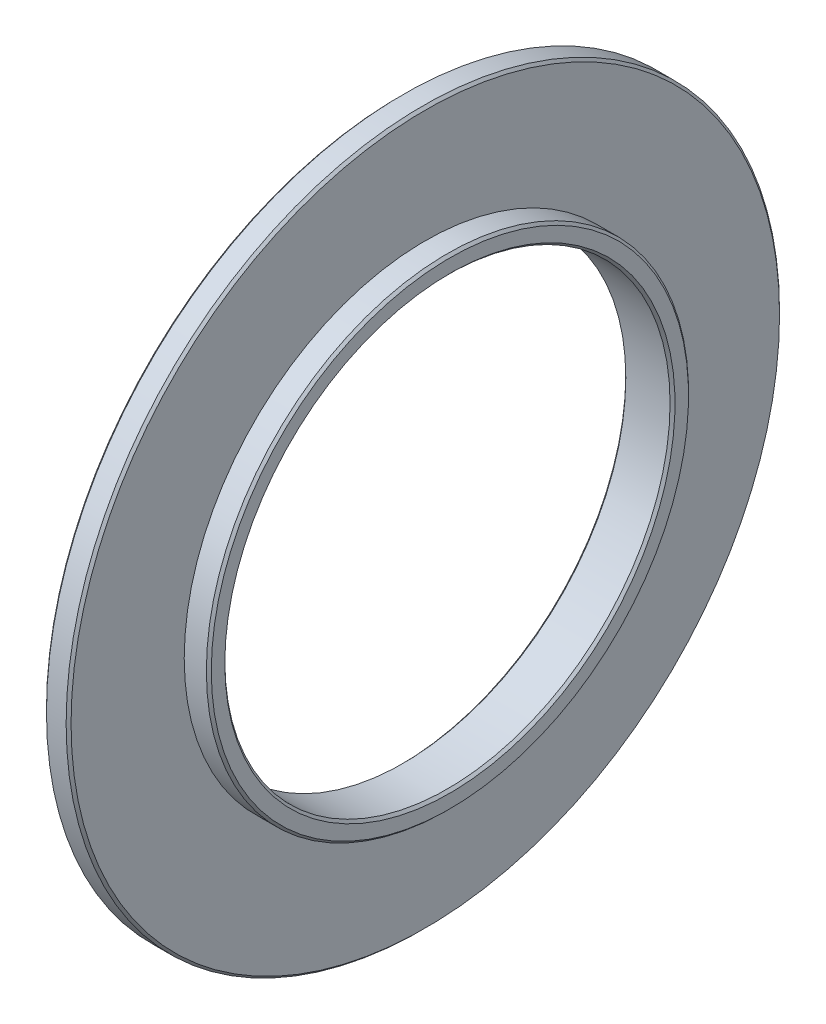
ISO-10303-21;
HEADER;
FILE_DESCRIPTION(('STEP AP214'),'2;1');
FILE_NAME('part.step','',(''),(''),'','','');
FILE_SCHEMA(('AUTOMOTIVE_DESIGN { 1 0 10303 214 1 1 1 1 }'));
ENDSEC;
DATA;
#1=APPLICATION_CONTEXT('core data for automotive mechanical design processes');
#2=APPLICATION_PROTOCOL_DEFINITION('international standard','automotive_design',2000,#1);
#3=PRODUCT_CONTEXT('',#1,'mechanical');
#4=PRODUCT('Part','Part','',(#3));
#5=PRODUCT_RELATED_PRODUCT_CATEGORY('part','',(#4));
#6=PRODUCT_DEFINITION_FORMATION('','',#4);
#7=PRODUCT_DEFINITION_CONTEXT('part definition',#1,'design');
#8=PRODUCT_DEFINITION('design','',#6,#7);
#9=PRODUCT_DEFINITION_SHAPE('','',#8);
#10=(LENGTH_UNIT() NAMED_UNIT(*) SI_UNIT(.MILLI.,.METRE.));
#11=(NAMED_UNIT(*) PLANE_ANGLE_UNIT() SI_UNIT($,.RADIAN.));
#12=(NAMED_UNIT(*) SI_UNIT($,.STERADIAN.) SOLID_ANGLE_UNIT());
#13=UNCERTAINTY_MEASURE_WITH_UNIT(LENGTH_MEASURE(1.E-05),#10,'distance_accuracy_value','');
#14=(GEOMETRIC_REPRESENTATION_CONTEXT(3) GLOBAL_UNCERTAINTY_ASSIGNED_CONTEXT((#13)) GLOBAL_UNIT_ASSIGNED_CONTEXT((#10,
#11,#12)) REPRESENTATION_CONTEXT('',''));
#15=CARTESIAN_POINT('',(0.,0.,0.));
#16=DIRECTION('',(0.,0.,1.));
#17=DIRECTION('',(1.,0.,0.));
#18=AXIS2_PLACEMENT_3D('',#15,#16,#17);
#19=CARTESIAN_POINT('',(0.,0.,0.));
#20=DIRECTION('',(-1.,0.,0.));
#21=DIRECTION('',(0.,0.,1.));
#22=AXIS2_PLACEMENT_3D('',#19,#20,#21);
#23=CYLINDRICAL_SURFACE('',#22,72.5);
#24=CARTESIAN_POINT('',(0.499999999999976,0.,0.));
#25=DIRECTION('',(1.,0.,0.));
#26=DIRECTION('',(0.,0.,-1.));
#27=AXIS2_PLACEMENT_3D('',#24,#25,#26);
#28=CIRCLE('',#27,72.5);
#29=CARTESIAN_POINT('',(0.499999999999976,0.,-72.5));
#30=VERTEX_POINT('',#29);
#31=EDGE_CURVE('E48',#30,#30,#28,.T.);
#32=ORIENTED_EDGE('',*,*,#31,.T.);
#33=EDGE_LOOP('',(#32));
#34=FACE_BOUND('',#33,.T.);
#35=CARTESIAN_POINT('',(4.50000000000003,0.,0.));
#36=DIRECTION('',(-1.,0.,0.));
#37=DIRECTION('',(0.,0.,1.));
#38=AXIS2_PLACEMENT_3D('',#35,#36,#37);
#39=CIRCLE('',#38,72.5);
#40=CARTESIAN_POINT('',(4.50000000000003,0.,72.5));
#41=VERTEX_POINT('',#40);
#42=EDGE_CURVE('E51',#41,#41,#39,.T.);
#43=ORIENTED_EDGE('',*,*,#42,.T.);
#44=EDGE_LOOP('',(#43));
#45=FACE_BOUND('',#44,.T.);
#46=ADVANCED_FACE('F29',(#34,#45),#23,.T.);
#47=CARTESIAN_POINT('',(5.,49.,0.));
#48=DIRECTION('',(-1.,0.,0.));
#49=DIRECTION('',(0.,0.,1.));
#50=AXIS2_PLACEMENT_3D('',#47,#48,#49);
#51=PLANE('',#50);
#52=CARTESIAN_POINT('',(5.,0.,0.));
#53=DIRECTION('',(-1.,0.,0.));
#54=DIRECTION('',(0.,0.,1.));
#55=AXIS2_PLACEMENT_3D('',#52,#53,#54);
#56=CIRCLE('',#55,72.);
#57=CARTESIAN_POINT('',(5.,0.,72.));
#58=VERTEX_POINT('',#57);
#59=EDGE_CURVE('E10',#58,#58,#56,.F.);
#60=ORIENTED_EDGE('',*,*,#59,.T.);
#61=EDGE_LOOP('',(#60));
#62=FACE_BOUND('',#61,.T.);
#63=CARTESIAN_POINT('',(5.,0.,0.));
#64=DIRECTION('',(-1.,0.,0.));
#65=DIRECTION('',(0.,0.,1.));
#66=AXIS2_PLACEMENT_3D('',#63,#64,#65);
#67=CIRCLE('',#66,49.);
#68=CARTESIAN_POINT('',(5.,0.,49.));
#69=VERTEX_POINT('',#68);
#70=EDGE_CURVE('E66',#69,#69,#67,.T.);
#71=ORIENTED_EDGE('',*,*,#70,.T.);
#72=EDGE_LOOP('',(#71));
#73=FACE_BOUND('',#72,.T.);
#74=ADVANCED_FACE('F70',(#62,#73),#51,.F.);
#75=CARTESIAN_POINT('',(0.,0.,0.));
#76=DIRECTION('',(-1.,0.,0.));
#77=DIRECTION('',(0.,0.,1.));
#78=AXIS2_PLACEMENT_3D('',#75,#76,#77);
#79=CYLINDRICAL_SURFACE('',#78,49.);
#80=CARTESIAN_POINT('',(9.5,0.,0.));
#81=DIRECTION('',(-1.,0.,0.));
#82=DIRECTION('',(0.,0.,1.));
#83=AXIS2_PLACEMENT_3D('',#80,#81,#82);
#84=CIRCLE('',#83,49.);
#85=CARTESIAN_POINT('',(9.5,0.,49.));
#86=VERTEX_POINT('',#85);
#87=EDGE_CURVE('E35',#86,#86,#84,.T.);
#88=ORIENTED_EDGE('',*,*,#87,.T.);
#89=EDGE_LOOP('',(#88));
#90=FACE_BOUND('',#89,.T.);
#91=ORIENTED_EDGE('',*,*,#70,.F.);
#92=EDGE_LOOP('',(#91));
#93=FACE_BOUND('',#92,.T.);
#94=ADVANCED_FACE('F72',(#90,#93),#79,.T.);
#95=CARTESIAN_POINT('',(10.,45.25,0.));
#96=DIRECTION('',(-1.,0.,0.));
#97=DIRECTION('',(0.,0.,1.));
#98=AXIS2_PLACEMENT_3D('',#95,#96,#97);
#99=PLANE('',#98);
#100=CARTESIAN_POINT('',(10.,0.,0.));
#101=DIRECTION('',(-1.,0.,0.));
#102=DIRECTION('',(0.,0.,1.));
#103=AXIS2_PLACEMENT_3D('',#100,#101,#102);
#104=CIRCLE('',#103,45.75);
#105=CARTESIAN_POINT('',(10.,0.,45.75));
#106=VERTEX_POINT('',#105);
#107=EDGE_CURVE('E39',#106,#106,#104,.T.);
#108=ORIENTED_EDGE('',*,*,#107,.T.);
#109=EDGE_LOOP('',(#108));
#110=FACE_BOUND('',#109,.T.);
#111=CARTESIAN_POINT('',(10.,0.,0.));
#112=DIRECTION('',(-1.,0.,0.));
#113=DIRECTION('',(0.,0.,1.));
#114=AXIS2_PLACEMENT_3D('',#111,#112,#113);
#115=CIRCLE('',#114,48.5);
#116=CARTESIAN_POINT('',(10.,0.,48.5));
#117=VERTEX_POINT('',#116);
#118=EDGE_CURVE('E43',#117,#117,#115,.F.);
#119=ORIENTED_EDGE('',*,*,#118,.T.);
#120=EDGE_LOOP('',(#119));
#121=FACE_BOUND('',#120,.T.);
#122=ADVANCED_FACE('F74',(#110,#121),#99,.F.);
#123=CARTESIAN_POINT('',(0.,0.,0.));
#124=DIRECTION('',(-1.,0.,0.));
#125=DIRECTION('',(0.,0.,1.));
#126=AXIS2_PLACEMENT_3D('',#123,#124,#125);
#127=CYLINDRICAL_SURFACE('',#126,45.25);
#128=CARTESIAN_POINT('',(0.500000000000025,0.,0.));
#129=DIRECTION('',(1.,0.,0.));
#130=DIRECTION('',(0.,0.,-1.));
#131=AXIS2_PLACEMENT_3D('',#128,#129,#130);
#132=CIRCLE('',#131,45.25);
#133=CARTESIAN_POINT('',(0.500000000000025,0.,-45.25));
#134=VERTEX_POINT('',#133);
#135=EDGE_CURVE('E60',#134,#134,#132,.F.);
#136=ORIENTED_EDGE('',*,*,#135,.T.);
#137=EDGE_LOOP('',(#136));
#138=FACE_BOUND('',#137,.T.);
#139=CARTESIAN_POINT('',(9.50000000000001,0.,0.));
#140=DIRECTION('',(-1.,0.,0.));
#141=DIRECTION('',(0.,0.,1.));
#142=AXIS2_PLACEMENT_3D('',#139,#140,#141);
#143=CIRCLE('',#142,45.25);
#144=CARTESIAN_POINT('',(9.50000000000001,0.,45.25));
#145=VERTEX_POINT('',#144);
#146=EDGE_CURVE('E63',#145,#145,#143,.F.);
#147=ORIENTED_EDGE('',*,*,#146,.T.);
#148=EDGE_LOOP('',(#147));
#149=FACE_BOUND('',#148,.T.);
#150=ADVANCED_FACE('F80',(#138,#149),#127,.F.);
#151=CARTESIAN_POINT('',(0.,72.5,0.));
#152=DIRECTION('',(1.,0.,0.));
#153=DIRECTION('',(0.,0.,-1.));
#154=AXIS2_PLACEMENT_3D('',#151,#152,#153);
#155=PLANE('',#154);
#156=CARTESIAN_POINT('',(0.,0.,0.));
#157=DIRECTION('',(1.,0.,0.));
#158=DIRECTION('',(0.,0.,-1.));
#159=AXIS2_PLACEMENT_3D('',#156,#157,#158);
#160=CIRCLE('',#159,45.75);
#161=CARTESIAN_POINT('',(0.,0.,-45.75));
#162=VERTEX_POINT('',#161);
#163=EDGE_CURVE('E54',#162,#162,#160,.T.);
#164=ORIENTED_EDGE('',*,*,#163,.T.);
#165=EDGE_LOOP('',(#164));
#166=FACE_BOUND('',#165,.T.);
#167=CARTESIAN_POINT('',(0.,0.,0.));
#168=DIRECTION('',(1.,0.,0.));
#169=DIRECTION('',(0.,0.,-1.));
#170=AXIS2_PLACEMENT_3D('',#167,#168,#169);
#171=CIRCLE('',#170,72.);
#172=CARTESIAN_POINT('',(0.,0.,-72.));
#173=VERTEX_POINT('',#172);
#174=EDGE_CURVE('E57',#173,#173,#171,.F.);
#175=ORIENTED_EDGE('',*,*,#174,.T.);
#176=EDGE_LOOP('',(#175));
#177=FACE_BOUND('',#176,.T.);
#178=ADVANCED_FACE('F113',(#166,#177),#155,.F.);
#179=CARTESIAN_POINT('',(0.500000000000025,0.,0.));
#180=DIRECTION('',(-1.,0.,0.));
#181=DIRECTION('',(0.,0.,1.));
#182=AXIS2_PLACEMENT_3D('',#179,#180,#181);
#183=CONICAL_SURFACE('',#182,45.25,0.785398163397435);
#184=ORIENTED_EDGE('',*,*,#163,.F.);
#185=EDGE_LOOP('',(#184));
#186=FACE_BOUND('',#185,.T.);
#187=ORIENTED_EDGE('',*,*,#135,.F.);
#188=EDGE_LOOP('',(#187));
#189=FACE_BOUND('',#188,.T.);
#190=ADVANCED_FACE('F109',(#186,#189),#183,.F.);
#191=CARTESIAN_POINT('',(0.,0.,0.));
#192=DIRECTION('',(1.,0.,0.));
#193=DIRECTION('',(0.,0.,-1.));
#194=AXIS2_PLACEMENT_3D('',#191,#192,#193);
#195=CONICAL_SURFACE('',#194,72.,0.785398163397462);
#196=ORIENTED_EDGE('',*,*,#31,.F.);
#197=EDGE_LOOP('',(#196));
#198=FACE_BOUND('',#197,.T.);
#199=ORIENTED_EDGE('',*,*,#174,.F.);
#200=EDGE_LOOP('',(#199));
#201=FACE_BOUND('',#200,.T.);
#202=ADVANCED_FACE('F105',(#198,#201),#195,.T.);
#203=CARTESIAN_POINT('',(10.,0.,0.));
#204=DIRECTION('',(1.,0.,0.));
#205=DIRECTION('',(0.,0.,-1.));
#206=AXIS2_PLACEMENT_3D('',#203,#204,#205);
#207=CONICAL_SURFACE('',#206,45.75,0.785398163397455);
#208=ORIENTED_EDGE('',*,*,#146,.F.);
#209=EDGE_LOOP('',(#208));
#210=FACE_BOUND('',#209,.T.);
#211=ORIENTED_EDGE('',*,*,#107,.F.);
#212=EDGE_LOOP('',(#211));
#213=FACE_BOUND('',#212,.T.);
#214=ADVANCED_FACE('F99',(#210,#213),#207,.F.);
#215=CARTESIAN_POINT('',(9.5,0.,0.));
#216=DIRECTION('',(-1.,0.,0.));
#217=DIRECTION('',(0.,0.,1.));
#218=AXIS2_PLACEMENT_3D('',#215,#216,#217);
#219=CONICAL_SURFACE('',#218,49.,0.785398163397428);
#220=ORIENTED_EDGE('',*,*,#118,.F.);
#221=EDGE_LOOP('',(#220));
#222=FACE_BOUND('',#221,.T.);
#223=ORIENTED_EDGE('',*,*,#87,.F.);
#224=EDGE_LOOP('',(#223));
#225=FACE_BOUND('',#224,.T.);
#226=ADVANCED_FACE('F93',(#222,#225),#219,.T.);
#227=CARTESIAN_POINT('',(4.50000000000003,0.,0.));
#228=DIRECTION('',(-1.,0.,0.));
#229=DIRECTION('',(0.,0.,1.));
#230=AXIS2_PLACEMENT_3D('',#227,#228,#229);
#231=CONICAL_SURFACE('',#230,72.5,0.785398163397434);
#232=ORIENTED_EDGE('',*,*,#59,.F.);
#233=EDGE_LOOP('',(#232));
#234=FACE_BOUND('',#233,.T.);
#235=ORIENTED_EDGE('',*,*,#42,.F.);
#236=EDGE_LOOP('',(#235));
#237=FACE_BOUND('',#236,.T.);
#238=ADVANCED_FACE('F91',(#234,#237),#231,.T.);
#239=CLOSED_SHELL('',(#46,#74,#94,#122,#150,#178,#190,#202,#214,#226,#238));
#240=MANIFOLD_SOLID_BREP('B2',#239);
#241=ADVANCED_BREP_SHAPE_REPRESENTATION('',(#18,#240),#14);
#242=SHAPE_DEFINITION_REPRESENTATION(#9,#241);
ENDSEC;
END-ISO-10303-21;
